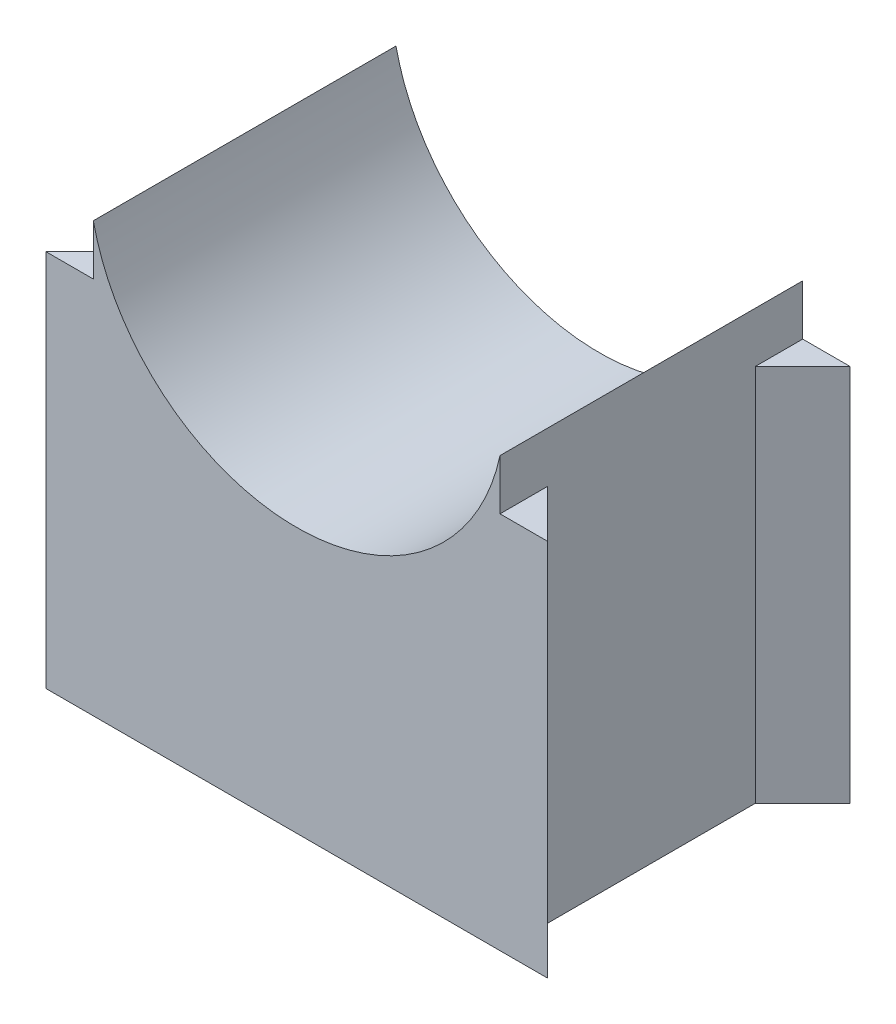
ISO-10303-21;
HEADER;
FILE_DESCRIPTION(('STEP AP214'),'2;1');
FILE_NAME('part.step','',(''),(''),'','','');
FILE_SCHEMA(('AUTOMOTIVE_DESIGN { 1 0 10303 214 1 1 1 1 }'));
ENDSEC;
DATA;
#1=APPLICATION_CONTEXT('core data for automotive mechanical design processes');
#2=APPLICATION_PROTOCOL_DEFINITION('international standard','automotive_design',2000,#1);
#3=PRODUCT_CONTEXT('',#1,'mechanical');
#4=PRODUCT('Part','Part','',(#3));
#5=PRODUCT_RELATED_PRODUCT_CATEGORY('part','',(#4));
#6=PRODUCT_DEFINITION_FORMATION('','',#4);
#7=PRODUCT_DEFINITION_CONTEXT('part definition',#1,'design');
#8=PRODUCT_DEFINITION('design','',#6,#7);
#9=PRODUCT_DEFINITION_SHAPE('','',#8);
#10=(LENGTH_UNIT() NAMED_UNIT(*) SI_UNIT(.MILLI.,.METRE.));
#11=(NAMED_UNIT(*) PLANE_ANGLE_UNIT() SI_UNIT($,.RADIAN.));
#12=(NAMED_UNIT(*) SI_UNIT($,.STERADIAN.) SOLID_ANGLE_UNIT());
#13=UNCERTAINTY_MEASURE_WITH_UNIT(LENGTH_MEASURE(1.E-05),#10,'distance_accuracy_value','');
#14=(GEOMETRIC_REPRESENTATION_CONTEXT(3) GLOBAL_UNCERTAINTY_ASSIGNED_CONTEXT((#13)) GLOBAL_UNIT_ASSIGNED_CONTEXT((#10,
#11,#12)) REPRESENTATION_CONTEXT('',''));
#15=CARTESIAN_POINT('',(0.,0.,0.));
#16=DIRECTION('',(0.,0.,1.));
#17=DIRECTION('',(1.,0.,0.));
#18=AXIS2_PLACEMENT_3D('',#15,#16,#17);
#19=CARTESIAN_POINT('',(10.75,0.,16.));
#20=DIRECTION('',(-1.,0.,0.));
#21=DIRECTION('',(0.,0.,1.));
#22=AXIS2_PLACEMENT_3D('',#19,#20,#21);
#23=PLANE('',#22);
#24=DIRECTION('',(0.,0.,-1.));
#25=VECTOR('',#24,1.);
#26=CARTESIAN_POINT('',(10.75,20.,13.5));
#27=LINE('',#26,#25);
#28=CARTESIAN_POINT('',(10.75,20.,16.));
#29=VERTEX_POINT('',#28);
#30=CARTESIAN_POINT('',(10.75,20.,13.5));
#31=VERTEX_POINT('',#30);
#32=EDGE_CURVE('E142',#29,#31,#27,.T.);
#33=ORIENTED_EDGE('',*,*,#32,.T.);
#34=DIRECTION('',(0.,-1.,0.));
#35=VECTOR('',#34,1.);
#36=CARTESIAN_POINT('',(10.75,20.,13.5));
#37=LINE('',#36,#35);
#38=CARTESIAN_POINT('',(10.75,0.,13.5));
#39=VERTEX_POINT('',#38);
#40=EDGE_CURVE('E128',#31,#39,#37,.T.);
#41=ORIENTED_EDGE('',*,*,#40,.T.);
#42=DIRECTION('',(0.,0.,-1.));
#43=VECTOR('',#42,1.);
#44=CARTESIAN_POINT('',(10.75,0.,16.));
#45=LINE('',#44,#43);
#46=CARTESIAN_POINT('',(10.75,0.,2.5));
#47=VERTEX_POINT('',#46);
#48=EDGE_CURVE('E221',#39,#47,#45,.T.);
#49=ORIENTED_EDGE('',*,*,#48,.T.);
#50=DIRECTION('',(0.,-1.,0.));
#51=VECTOR('',#50,1.);
#52=CARTESIAN_POINT('',(10.75,20.,2.5));
#53=LINE('',#52,#51);
#54=CARTESIAN_POINT('',(10.75,20.,2.5));
#55=VERTEX_POINT('',#54);
#56=EDGE_CURVE('E162',#55,#47,#53,.T.);
#57=ORIENTED_EDGE('',*,*,#56,.F.);
#58=DIRECTION('',(0.,0.,-1.));
#59=VECTOR('',#58,1.);
#60=CARTESIAN_POINT('',(10.75,20.,2.5));
#61=LINE('',#60,#59);
#62=CARTESIAN_POINT('',(10.75,20.,0.));
#63=VERTEX_POINT('',#62);
#64=EDGE_CURVE('E153',#55,#63,#61,.T.);
#65=ORIENTED_EDGE('',*,*,#64,.T.);
#66=DIRECTION('',(0.,1.,0.));
#67=VECTOR('',#66,1.);
#68=CARTESIAN_POINT('',(10.75,0.,0.));
#69=LINE('',#68,#67);
#70=CARTESIAN_POINT('',(10.75,22.6681552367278,0.));
#71=VERTEX_POINT('',#70);
#72=EDGE_CURVE('E205',#63,#71,#69,.T.);
#73=ORIENTED_EDGE('',*,*,#72,.T.);
#74=DIRECTION('',(0.,0.,-1.));
#75=VECTOR('',#74,1.);
#76=CARTESIAN_POINT('',(10.75,22.6681552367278,16.));
#77=LINE('',#76,#75);
#78=CARTESIAN_POINT('',(10.75,22.6681552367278,16.));
#79=VERTEX_POINT('',#78);
#80=EDGE_CURVE('E211',#79,#71,#77,.T.);
#81=ORIENTED_EDGE('',*,*,#80,.F.);
#82=DIRECTION('',(0.,1.,0.));
#83=VECTOR('',#82,1.);
#84=CARTESIAN_POINT('',(10.75,0.,16.));
#85=LINE('',#84,#83);
#86=EDGE_CURVE('E146',#29,#79,#85,.T.);
#87=ORIENTED_EDGE('',*,*,#86,.F.);
#88=EDGE_LOOP('',(#33,#41,#49,#57,#65,#73,#81,#87));
#89=FACE_BOUND('',#88,.T.);
#90=ADVANCED_FACE('F38',(#89),#23,.F.);
#91=CARTESIAN_POINT('',(-10.75,0.,16.));
#92=DIRECTION('',(1.,0.,0.));
#93=DIRECTION('',(0.,0.,-1.));
#94=AXIS2_PLACEMENT_3D('',#91,#92,#93);
#95=PLANE('',#94);
#96=DIRECTION('',(0.,0.,1.));
#97=VECTOR('',#96,1.);
#98=CARTESIAN_POINT('',(-10.75,20.,2.5));
#99=LINE('',#98,#97);
#100=CARTESIAN_POINT('',(-10.75,20.,0.));
#101=VERTEX_POINT('',#100);
#102=CARTESIAN_POINT('',(-10.75,20.,2.5));
#103=VERTEX_POINT('',#102);
#104=EDGE_CURVE('E171',#101,#103,#99,.T.);
#105=ORIENTED_EDGE('',*,*,#104,.T.);
#106=DIRECTION('',(0.,-1.,0.));
#107=VECTOR('',#106,1.);
#108=CARTESIAN_POINT('',(-10.75,20.,2.5));
#109=LINE('',#108,#107);
#110=CARTESIAN_POINT('',(-10.75,0.,2.5));
#111=VERTEX_POINT('',#110);
#112=EDGE_CURVE('E176',#103,#111,#109,.T.);
#113=ORIENTED_EDGE('',*,*,#112,.T.);
#114=DIRECTION('',(0.,0.,-1.));
#115=VECTOR('',#114,1.);
#116=CARTESIAN_POINT('',(-10.75,0.,16.));
#117=LINE('',#116,#115);
#118=CARTESIAN_POINT('',(-10.75,0.,13.5));
#119=VERTEX_POINT('',#118);
#120=EDGE_CURVE('E46',#119,#111,#117,.T.);
#121=ORIENTED_EDGE('',*,*,#120,.F.);
#122=DIRECTION('',(0.,-1.,0.));
#123=VECTOR('',#122,1.);
#124=CARTESIAN_POINT('',(-10.75,20.,13.5));
#125=LINE('',#124,#123);
#126=CARTESIAN_POINT('',(-10.75,20.,13.5));
#127=VERTEX_POINT('',#126);
#128=EDGE_CURVE('E196',#127,#119,#125,.T.);
#129=ORIENTED_EDGE('',*,*,#128,.F.);
#130=DIRECTION('',(0.,0.,1.));
#131=VECTOR('',#130,1.);
#132=CARTESIAN_POINT('',(-10.75,20.,13.5));
#133=LINE('',#132,#131);
#134=CARTESIAN_POINT('',(-10.75,20.,16.));
#135=VERTEX_POINT('',#134);
#136=EDGE_CURVE('E184',#127,#135,#133,.T.);
#137=ORIENTED_EDGE('',*,*,#136,.T.);
#138=DIRECTION('',(0.,-1.,0.));
#139=VECTOR('',#138,1.);
#140=CARTESIAN_POINT('',(-10.75,0.,16.));
#141=LINE('',#140,#139);
#142=CARTESIAN_POINT('',(-10.75,22.6681552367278,16.));
#143=VERTEX_POINT('',#142);
#144=EDGE_CURVE('E204',#143,#135,#141,.T.);
#145=ORIENTED_EDGE('',*,*,#144,.F.);
#146=DIRECTION('',(0.,0.,-1.));
#147=VECTOR('',#146,1.);
#148=CARTESIAN_POINT('',(-10.75,22.6681552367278,16.));
#149=LINE('',#148,#147);
#150=CARTESIAN_POINT('',(-10.75,22.6681552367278,0.));
#151=VERTEX_POINT('',#150);
#152=EDGE_CURVE('E11',#143,#151,#149,.T.);
#153=ORIENTED_EDGE('',*,*,#152,.T.);
#154=DIRECTION('',(0.,-1.,0.));
#155=VECTOR('',#154,1.);
#156=CARTESIAN_POINT('',(-10.75,0.,0.));
#157=LINE('',#156,#155);
#158=EDGE_CURVE('E214',#151,#101,#157,.T.);
#159=ORIENTED_EDGE('',*,*,#158,.T.);
#160=EDGE_LOOP('',(#105,#113,#121,#129,#137,#145,#153,#159));
#161=FACE_BOUND('',#160,.T.);
#162=ADVANCED_FACE('F241',(#161),#95,.F.);
#163=CARTESIAN_POINT('',(0.,25.,16.));
#164=DIRECTION('',(0.,0.,-1.));
#165=DIRECTION('',(-1.,0.,0.));
#166=AXIS2_PLACEMENT_3D('',#163,#164,#165);
#167=CYLINDRICAL_SURFACE('',#166,11.);
#168=CARTESIAN_POINT('',(0.,25.,0.));
#169=DIRECTION('',(0.,0.,-1.));
#170=DIRECTION('',(1.,0.,0.));
#171=AXIS2_PLACEMENT_3D('',#168,#169,#170);
#172=CIRCLE('',#171,11.);
#173=EDGE_CURVE('E198',#71,#151,#172,.T.);
#174=ORIENTED_EDGE('',*,*,#173,.T.);
#175=ORIENTED_EDGE('',*,*,#152,.F.);
#176=CARTESIAN_POINT('',(0.,25.,16.));
#177=DIRECTION('',(0.,0.,-1.));
#178=DIRECTION('',(1.,0.,0.));
#179=AXIS2_PLACEMENT_3D('',#176,#177,#178);
#180=CIRCLE('',#179,11.);
#181=EDGE_CURVE('E201',#79,#143,#180,.T.);
#182=ORIENTED_EDGE('',*,*,#181,.F.);
#183=ORIENTED_EDGE('',*,*,#80,.T.);
#184=EDGE_LOOP('',(#174,#175,#182,#183));
#185=FACE_BOUND('',#184,.T.);
#186=ADVANCED_FACE('F40',(#185),#167,.F.);
#187=CARTESIAN_POINT('',(10.75,0.,16.));
#188=DIRECTION('',(0.,1.,0.));
#189=DIRECTION('',(0.,0.,1.));
#190=AXIS2_PLACEMENT_3D('',#187,#188,#189);
#191=PLANE('',#190);
#192=DIRECTION('',(1.,0.,0.));
#193=VECTOR('',#192,1.);
#194=CARTESIAN_POINT('',(10.75,0.,0.));
#195=LINE('',#194,#193);
#196=CARTESIAN_POINT('',(-13.25,0.,0.));
#197=VERTEX_POINT('',#196);
#198=CARTESIAN_POINT('',(13.25,0.,0.));
#199=VERTEX_POINT('',#198);
#200=EDGE_CURVE('E216',#197,#199,#195,.T.);
#201=ORIENTED_EDGE('',*,*,#200,.T.);
#202=DIRECTION('',(-0.707106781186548,0.,0.707106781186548));
#203=VECTOR('',#202,1.);
#204=CARTESIAN_POINT('',(13.25,0.,0.));
#205=LINE('',#204,#203);
#206=EDGE_CURVE('E151',#199,#47,#205,.T.);
#207=ORIENTED_EDGE('',*,*,#206,.T.);
#208=ORIENTED_EDGE('',*,*,#48,.F.);
#209=DIRECTION('',(0.707106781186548,0.,0.707106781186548));
#210=VECTOR('',#209,1.);
#211=CARTESIAN_POINT('',(13.25,0.,16.));
#212=LINE('',#211,#210);
#213=CARTESIAN_POINT('',(13.25,0.,16.));
#214=VERTEX_POINT('',#213);
#215=EDGE_CURVE('E134',#39,#214,#212,.T.);
#216=ORIENTED_EDGE('',*,*,#215,.T.);
#217=DIRECTION('',(1.,0.,0.));
#218=VECTOR('',#217,1.);
#219=CARTESIAN_POINT('',(10.75,0.,16.));
#220=LINE('',#219,#218);
#221=CARTESIAN_POINT('',(-13.25,0.,16.));
#222=VERTEX_POINT('',#221);
#223=EDGE_CURVE('E208',#222,#214,#220,.T.);
#224=ORIENTED_EDGE('',*,*,#223,.F.);
#225=DIRECTION('',(0.707106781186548,0.,-0.707106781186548));
#226=VECTOR('',#225,1.);
#227=CARTESIAN_POINT('',(-13.25,0.,16.));
#228=LINE('',#227,#226);
#229=EDGE_CURVE('E182',#222,#119,#228,.T.);
#230=ORIENTED_EDGE('',*,*,#229,.T.);
#231=ORIENTED_EDGE('',*,*,#120,.T.);
#232=DIRECTION('',(-0.707106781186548,0.,-0.707106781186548));
#233=VECTOR('',#232,1.);
#234=CARTESIAN_POINT('',(-13.25,0.,0.));
#235=LINE('',#234,#233);
#236=EDGE_CURVE('E165',#111,#197,#235,.T.);
#237=ORIENTED_EDGE('',*,*,#236,.T.);
#238=EDGE_LOOP('',(#201,#207,#208,#216,#224,#230,#231,#237));
#239=FACE_BOUND('',#238,.T.);
#240=ADVANCED_FACE('F226',(#239),#191,.F.);
#241=CARTESIAN_POINT('',(0.,25.,16.));
#242=DIRECTION('',(0.,0.,1.));
#243=DIRECTION('',(1.,0.,0.));
#244=AXIS2_PLACEMENT_3D('',#241,#242,#243);
#245=PLANE('',#244);
#246=ORIENTED_EDGE('',*,*,#181,.T.);
#247=ORIENTED_EDGE('',*,*,#144,.T.);
#248=DIRECTION('',(-1.,0.,0.));
#249=VECTOR('',#248,1.);
#250=CARTESIAN_POINT('',(-10.75,20.,16.));
#251=LINE('',#250,#249);
#252=CARTESIAN_POINT('',(-13.25,20.,16.));
#253=VERTEX_POINT('',#252);
#254=EDGE_CURVE('E187',#135,#253,#251,.T.);
#255=ORIENTED_EDGE('',*,*,#254,.T.);
#256=DIRECTION('',(0.,-1.,0.));
#257=VECTOR('',#256,1.);
#258=CARTESIAN_POINT('',(-13.25,20.,16.));
#259=LINE('',#258,#257);
#260=EDGE_CURVE('E193',#253,#222,#259,.T.);
#261=ORIENTED_EDGE('',*,*,#260,.T.);
#262=ORIENTED_EDGE('',*,*,#223,.T.);
#263=DIRECTION('',(0.,-1.,0.));
#264=VECTOR('',#263,1.);
#265=CARTESIAN_POINT('',(13.25,20.,16.));
#266=LINE('',#265,#264);
#267=CARTESIAN_POINT('',(13.25,20.,16.));
#268=VERTEX_POINT('',#267);
#269=EDGE_CURVE('E138',#268,#214,#266,.T.);
#270=ORIENTED_EDGE('',*,*,#269,.F.);
#271=DIRECTION('',(-1.,0.,0.));
#272=VECTOR('',#271,1.);
#273=CARTESIAN_POINT('',(10.75,20.,16.));
#274=LINE('',#273,#272);
#275=EDGE_CURVE('E53',#268,#29,#274,.T.);
#276=ORIENTED_EDGE('',*,*,#275,.T.);
#277=ORIENTED_EDGE('',*,*,#86,.T.);
#278=EDGE_LOOP('',(#246,#247,#255,#261,#262,#270,#276,#277));
#279=FACE_BOUND('',#278,.T.);
#280=ADVANCED_FACE('F251',(#279),#245,.T.);
#281=CARTESIAN_POINT('',(0.,25.,0.));
#282=DIRECTION('',(0.,0.,1.));
#283=DIRECTION('',(1.,0.,0.));
#284=AXIS2_PLACEMENT_3D('',#281,#282,#283);
#285=PLANE('',#284);
#286=ORIENTED_EDGE('',*,*,#173,.F.);
#287=ORIENTED_EDGE('',*,*,#72,.F.);
#288=DIRECTION('',(1.,0.,0.));
#289=VECTOR('',#288,1.);
#290=CARTESIAN_POINT('',(10.75,20.,0.));
#291=LINE('',#290,#289);
#292=CARTESIAN_POINT('',(13.25,20.,0.));
#293=VERTEX_POINT('',#292);
#294=EDGE_CURVE('E61',#63,#293,#291,.T.);
#295=ORIENTED_EDGE('',*,*,#294,.T.);
#296=DIRECTION('',(0.,-1.,0.));
#297=VECTOR('',#296,1.);
#298=CARTESIAN_POINT('',(13.25,20.,0.));
#299=LINE('',#298,#297);
#300=EDGE_CURVE('E159',#293,#199,#299,.T.);
#301=ORIENTED_EDGE('',*,*,#300,.T.);
#302=ORIENTED_EDGE('',*,*,#200,.F.);
#303=DIRECTION('',(0.,-1.,0.));
#304=VECTOR('',#303,1.);
#305=CARTESIAN_POINT('',(-13.25,20.,0.));
#306=LINE('',#305,#304);
#307=CARTESIAN_POINT('',(-13.25,20.,0.));
#308=VERTEX_POINT('',#307);
#309=EDGE_CURVE('E179',#308,#197,#306,.T.);
#310=ORIENTED_EDGE('',*,*,#309,.F.);
#311=DIRECTION('',(1.,0.,0.));
#312=VECTOR('',#311,1.);
#313=CARTESIAN_POINT('',(-10.75,20.,0.));
#314=LINE('',#313,#312);
#315=EDGE_CURVE('E168',#308,#101,#314,.T.);
#316=ORIENTED_EDGE('',*,*,#315,.T.);
#317=ORIENTED_EDGE('',*,*,#158,.F.);
#318=EDGE_LOOP('',(#286,#287,#295,#301,#302,#310,#316,#317));
#319=FACE_BOUND('',#318,.T.);
#320=ADVANCED_FACE('F237',(#319),#285,.F.);
#321=CARTESIAN_POINT('',(-13.25,20.,16.));
#322=DIRECTION('',(-0.707106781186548,0.,-0.707106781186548));
#323=DIRECTION('',(-0.707106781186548,0.,0.707106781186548));
#324=AXIS2_PLACEMENT_3D('',#321,#322,#323);
#325=PLANE('',#324);
#326=ORIENTED_EDGE('',*,*,#229,.F.);
#327=ORIENTED_EDGE('',*,*,#260,.F.);
#328=DIRECTION('',(0.707106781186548,0.,-0.707106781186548));
#329=VECTOR('',#328,1.);
#330=CARTESIAN_POINT('',(-13.25,20.,16.));
#331=LINE('',#330,#329);
#332=EDGE_CURVE('E190',#253,#127,#331,.T.);
#333=ORIENTED_EDGE('',*,*,#332,.T.);
#334=ORIENTED_EDGE('',*,*,#128,.T.);
#335=EDGE_LOOP('',(#326,#327,#333,#334));
#336=FACE_BOUND('',#335,.T.);
#337=ADVANCED_FACE('F254',(#336),#325,.T.);
#338=CARTESIAN_POINT('',(0.,20.,0.));
#339=DIRECTION('',(0.,-1.,0.));
#340=DIRECTION('',(0.,0.,-1.));
#341=AXIS2_PLACEMENT_3D('',#338,#339,#340);
#342=PLANE('',#341);
#343=ORIENTED_EDGE('',*,*,#136,.F.);
#344=ORIENTED_EDGE('',*,*,#332,.F.);
#345=ORIENTED_EDGE('',*,*,#254,.F.);
#346=EDGE_LOOP('',(#343,#344,#345));
#347=FACE_BOUND('',#346,.T.);
#348=ADVANCED_FACE('F256',(#347),#342,.F.);
#349=CARTESIAN_POINT('',(-13.25,20.,0.));
#350=DIRECTION('',(-0.707106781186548,0.,0.707106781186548));
#351=DIRECTION('',(0.707106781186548,0.,0.707106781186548));
#352=AXIS2_PLACEMENT_3D('',#349,#350,#351);
#353=PLANE('',#352);
#354=ORIENTED_EDGE('',*,*,#236,.F.);
#355=ORIENTED_EDGE('',*,*,#112,.F.);
#356=DIRECTION('',(-0.707106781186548,0.,-0.707106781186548));
#357=VECTOR('',#356,1.);
#358=CARTESIAN_POINT('',(-13.25,20.,0.));
#359=LINE('',#358,#357);
#360=EDGE_CURVE('E173',#103,#308,#359,.T.);
#361=ORIENTED_EDGE('',*,*,#360,.T.);
#362=ORIENTED_EDGE('',*,*,#309,.T.);
#363=EDGE_LOOP('',(#354,#355,#361,#362));
#364=FACE_BOUND('',#363,.T.);
#365=ADVANCED_FACE('F232',(#364),#353,.T.);
#366=CARTESIAN_POINT('',(0.,20.,0.));
#367=DIRECTION('',(0.,-1.,0.));
#368=DIRECTION('',(0.,0.,-1.));
#369=AXIS2_PLACEMENT_3D('',#366,#367,#368);
#370=PLANE('',#369);
#371=ORIENTED_EDGE('',*,*,#315,.F.);
#372=ORIENTED_EDGE('',*,*,#360,.F.);
#373=ORIENTED_EDGE('',*,*,#104,.F.);
#374=EDGE_LOOP('',(#371,#372,#373));
#375=FACE_BOUND('',#374,.T.);
#376=ADVANCED_FACE('F240',(#375),#370,.F.);
#377=CARTESIAN_POINT('',(13.25,20.,0.));
#378=DIRECTION('',(0.707106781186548,0.,0.707106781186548));
#379=DIRECTION('',(0.707106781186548,0.,-0.707106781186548));
#380=AXIS2_PLACEMENT_3D('',#377,#378,#379);
#381=PLANE('',#380);
#382=ORIENTED_EDGE('',*,*,#206,.F.);
#383=ORIENTED_EDGE('',*,*,#300,.F.);
#384=DIRECTION('',(-0.707106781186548,0.,0.707106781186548));
#385=VECTOR('',#384,1.);
#386=CARTESIAN_POINT('',(13.25,20.,0.));
#387=LINE('',#386,#385);
#388=EDGE_CURVE('E156',#293,#55,#387,.T.);
#389=ORIENTED_EDGE('',*,*,#388,.T.);
#390=ORIENTED_EDGE('',*,*,#56,.T.);
#391=EDGE_LOOP('',(#382,#383,#389,#390));
#392=FACE_BOUND('',#391,.T.);
#393=ADVANCED_FACE('F250',(#392),#381,.T.);
#394=CARTESIAN_POINT('',(0.,20.,0.));
#395=DIRECTION('',(0.,-1.,0.));
#396=DIRECTION('',(0.,0.,-1.));
#397=AXIS2_PLACEMENT_3D('',#394,#395,#396);
#398=PLANE('',#397);
#399=ORIENTED_EDGE('',*,*,#64,.F.);
#400=ORIENTED_EDGE('',*,*,#388,.F.);
#401=ORIENTED_EDGE('',*,*,#294,.F.);
#402=EDGE_LOOP('',(#399,#400,#401));
#403=FACE_BOUND('',#402,.T.);
#404=ADVANCED_FACE('F247',(#403),#398,.F.);
#405=CARTESIAN_POINT('',(13.25,20.,16.));
#406=DIRECTION('',(0.707106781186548,0.,-0.707106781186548));
#407=DIRECTION('',(-0.707106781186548,0.,-0.707106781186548));
#408=AXIS2_PLACEMENT_3D('',#405,#406,#407);
#409=PLANE('',#408);
#410=ORIENTED_EDGE('',*,*,#215,.F.);
#411=ORIENTED_EDGE('',*,*,#40,.F.);
#412=DIRECTION('',(0.707106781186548,0.,0.707106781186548));
#413=VECTOR('',#412,1.);
#414=CARTESIAN_POINT('',(13.25,20.,16.));
#415=LINE('',#414,#413);
#416=EDGE_CURVE('E132',#31,#268,#415,.T.);
#417=ORIENTED_EDGE('',*,*,#416,.T.);
#418=ORIENTED_EDGE('',*,*,#269,.T.);
#419=EDGE_LOOP('',(#410,#411,#417,#418));
#420=FACE_BOUND('',#419,.T.);
#421=ADVANCED_FACE('F130',(#420),#409,.T.);
#422=CARTESIAN_POINT('',(0.,20.,0.));
#423=DIRECTION('',(0.,-1.,0.));
#424=DIRECTION('',(0.,0.,-1.));
#425=AXIS2_PLACEMENT_3D('',#422,#423,#424);
#426=PLANE('',#425);
#427=ORIENTED_EDGE('',*,*,#275,.F.);
#428=ORIENTED_EDGE('',*,*,#416,.F.);
#429=ORIENTED_EDGE('',*,*,#32,.F.);
#430=EDGE_LOOP('',(#427,#428,#429));
#431=FACE_BOUND('',#430,.T.);
#432=ADVANCED_FACE('F141',(#431),#426,.F.);
#433=CLOSED_SHELL('',(#90,#162,#186,#240,#280,#320,#337,#348,#365,#376,#393,#404,#421,#432));
#434=MANIFOLD_SOLID_BREP('B2',#433);
#435=ADVANCED_BREP_SHAPE_REPRESENTATION('',(#18,#434),#14);
#436=SHAPE_DEFINITION_REPRESENTATION(#9,#435);
ENDSEC;
END-ISO-10303-21;
